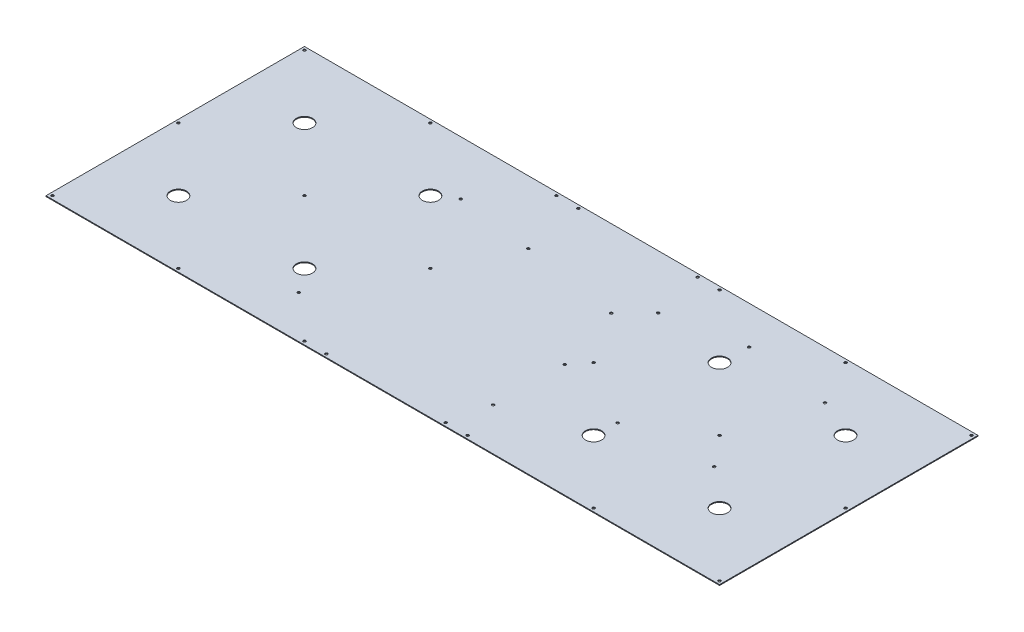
from build123d import *

# Parameters (mm, degrees)
MAIN_PLATE_W        = 834
MAIN_PLATE_H        = 320
BOSS_EXTRUDE1_DEPTH = 1.016
MAIN_HOLES_R        = 1.6
CUT_EXTRUDE1_DEPTH  = 447.64307031
SMA_R               = 10
CUT_EXTRUDE2_DEPTH  = 447.64307031
SKETCH3_R           = 1.6
CUT_EXTRUDE3_DEPTH  = 447.64307031


with BuildPart() as part:
    # main_plate → Boss-Extrude1 (new body)
    with BuildSketch(Plane(origin=(0, 0, 0), x_dir=(1, 0, 0), z_dir=(0, 1, 0))):
        Rectangle(MAIN_PLATE_W, MAIN_PLATE_H)
    extrude(amount=BOSS_EXTRUDE1_DEPTH)

    # main_holes → Cut-Extrude1 (cut, through all)
    with BuildSketch(Plane(origin=(0, 1.016, 0), x_dir=(1, 0, 0), z_dir=(0, 1, 0))):
        with Locations(Location((-413, 156, 0), (0, 0, 270))):
            Circle(MAIN_HOLES_R)
        with Locations(Location((-257, 156, 0), (0, 0, 270))):
            Circle(MAIN_HOLES_R)
        with Locations(Location((-101, 156, 0), (0, 0, 270))):
            Circle(MAIN_HOLES_R)
        with Locations(Location((-257, 0, 0), (0, 0, 270))):
            Circle(MAIN_HOLES_R)
        with Locations(Location((-101, 0, 0), (0, 0, 270))):
            Circle(MAIN_HOLES_R)
        with Locations(Location((-257, -156, 0), (0, 0, 270))):
            Circle(MAIN_HOLES_R)
        with Locations(Location((-101, -156, 0), (0, 0, 270))):
            Circle(MAIN_HOLES_R)
        with Locations(Location((-413, 0, 0), (0, 0, 270))):
            Circle(MAIN_HOLES_R)
        with Locations(Location((-413, -156, 0), (0, 0, 270))):
            Circle(MAIN_HOLES_R)
        with Locations(Location((413, -156, 0), (0, 0, 90))):
            Circle(MAIN_HOLES_R)
        with Locations(Location((413, 0, 0), (0, 0, 90))):
            Circle(MAIN_HOLES_R)
        with Locations(Location((101, -156, 0), (0, 0, 90))):
            Circle(MAIN_HOLES_R)
        with Locations(Location((257, -156, 0), (0, 0, 90))):
            Circle(MAIN_HOLES_R)
        with Locations(Location((101, 0, 0), (0, 0, 90))):
            Circle(MAIN_HOLES_R)
        with Locations(Location((257, 0, 0), (0, 0, 90))):
            Circle(MAIN_HOLES_R)
        with Locations(Location((101, 156, 0), (0, 0, 90))):
            Circle(MAIN_HOLES_R)
        with Locations(Location((257, 156, 0), (0, 0, 90))):
            Circle(MAIN_HOLES_R)
        with Locations(Location((413, 156, 0), (0, 0, 90))):
            Circle(MAIN_HOLES_R)
        with Locations(Location((-73.81875, 156, 0), (0, 0, 270))):
            Circle(MAIN_HOLES_R)
        with Locations(Location((73.81875, 156, 0), (0, 0, 90))):
            Circle(MAIN_HOLES_R)
        with Locations(Location((73.81875, -156, 0), (0, 0, 270))):
            Circle(MAIN_HOLES_R)
        with Locations(Location((-73.81875, -156, 0), (0, 0, 90))):
            Circle(MAIN_HOLES_R)
    extrude(amount=-CUT_EXTRUDE1_DEPTH, mode=Mode.SUBTRACT)

    # sma → Cut-Extrude2 (cut, through all)
    with BuildSketch(Plane(origin=(0, 1.016, 0), x_dir=(1, 0, 0), z_dir=(0, 1, 0))):
        with Locations(Location((-335, 78, 0), (0, 0, 270))):
            Circle(SMA_R)
        with Locations(Location((-179, 78, 0), (0, 0, 270))):
            Circle(SMA_R)
        with Locations(Location((-179, -78, 0), (0, 0, 270))):
            Circle(SMA_R)
        with Locations(Location((-335, -78, 0), (0, 0, 270))):
            Circle(SMA_R)
        with Locations(Location((335, 78, 0), (0, 0, 90))):
            Circle(SMA_R)
        with Locations(Location((179, 78, 0), (0, 0, 90))):
            Circle(SMA_R)
        with Locations(Location((335, -78, 0), (0, 0, 90))):
            Circle(SMA_R)
        with Locations(Location((179, -78, 0), (0, 0, 90))):
            Circle(SMA_R)
    extrude(amount=-CUT_EXTRUDE2_DEPTH, mode=Mode.SUBTRACT)

    # Sketch3 → Cut-Extrude3 (cut, through all)
    with BuildSketch(Plane(origin=(0, 1.016, 0), x_dir=(1, 0, 0), z_dir=(0, 1, 0))):
        with Locations(Location((180.624415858, 112.936757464, 0), (0, 0, 270))):
            Circle(SKETCH3_R)
        with Locations(Location((287.304415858, 100.179523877, 0), (0, 0, 270))):
            Circle(SKETCH3_R)
        with Locations(Location((287.230832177, -36.980456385, 0), (0, 0, 90))):
            Circle(SKETCH3_R)
        with Locations(Location((180.53720557, -49.623219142, 0), (0, 0, 90))):
            Circle(SKETCH3_R)
        with Locations(Location((-156.795231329, 93.209451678, 0), (0, 0, 270))):
            Circle(SKETCH3_R)
        with Locations(Location((-156.805231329, -107.450548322, 0), (0, 0, 270))):
            Circle(SKETCH3_R)
        with Locations(Location((85.304768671, -19.820548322, 0), (0, 0, 270))):
            Circle(SKETCH3_R)
        with Locations(Location((84.03720557, -107.450548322, 0), (0, 0, 270))):
            Circle(SKETCH3_R)
        with Locations(Location((58.924768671, 63.919451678, 0), (0, 0, 270))):
            Circle(SKETCH3_R)
        with Locations(Location((87.674768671, 93.209451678, 0), (0, 0, 270))):
            Circle(SKETCH3_R)
        with Locations(Location((-61.545231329, 81.819451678, 0), (0, 0, 270))):
            Circle(SKETCH3_R)
    extrude(amount=-CUT_EXTRUDE3_DEPTH, mode=Mode.SUBTRACT)


solid = part.part
